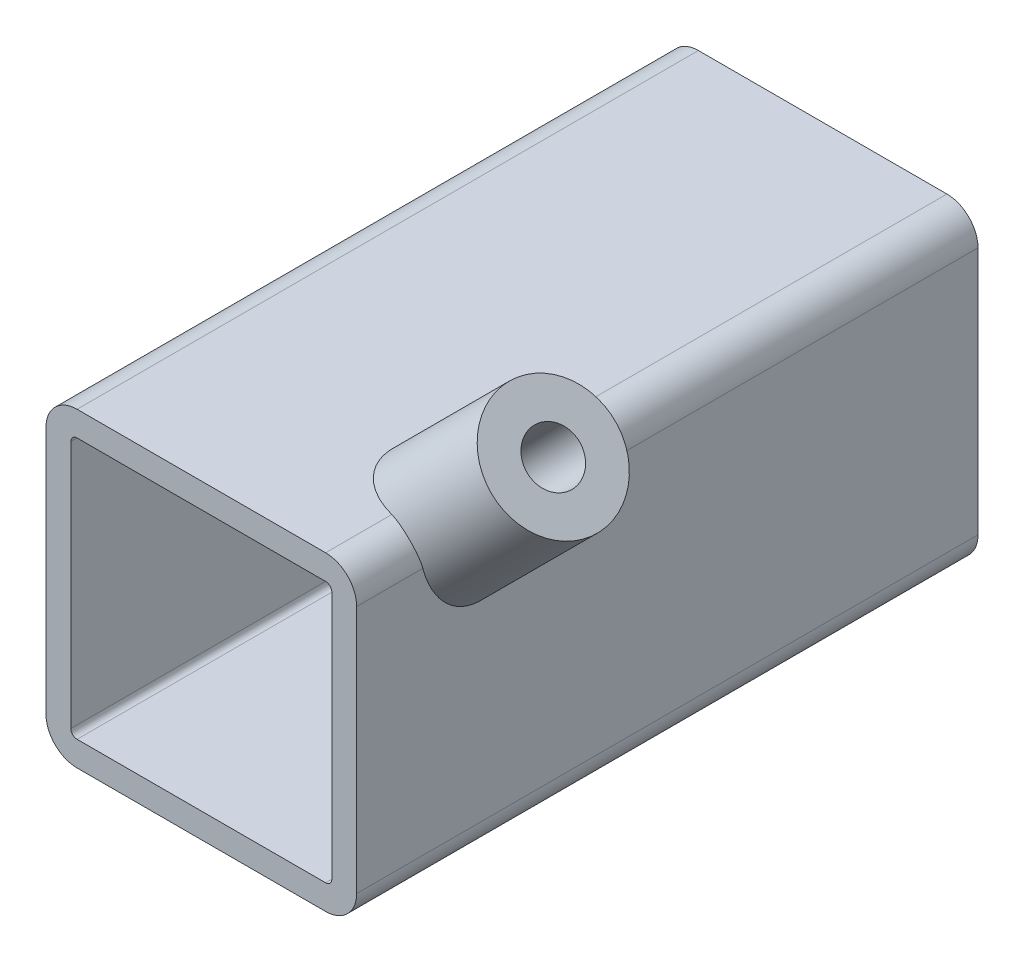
ISO-10303-21;
HEADER;
FILE_DESCRIPTION(('STEP AP214'),'2;1');
FILE_NAME('part.step','',(''),(''),'','','');
FILE_SCHEMA(('AUTOMOTIVE_DESIGN { 1 0 10303 214 1 1 1 1 }'));
ENDSEC;
DATA;
#1=APPLICATION_CONTEXT('core data for automotive mechanical design processes');
#2=APPLICATION_PROTOCOL_DEFINITION('international standard','automotive_design',2000,#1);
#3=PRODUCT_CONTEXT('',#1,'mechanical');
#4=PRODUCT('Part','Part','',(#3));
#5=PRODUCT_RELATED_PRODUCT_CATEGORY('part','',(#4));
#6=PRODUCT_DEFINITION_FORMATION('','',#4);
#7=PRODUCT_DEFINITION_CONTEXT('part definition',#1,'design');
#8=PRODUCT_DEFINITION('design','',#6,#7);
#9=PRODUCT_DEFINITION_SHAPE('','',#8);
#10=(LENGTH_UNIT() NAMED_UNIT(*) SI_UNIT(.MILLI.,.METRE.));
#11=(NAMED_UNIT(*) PLANE_ANGLE_UNIT() SI_UNIT($,.RADIAN.));
#12=(NAMED_UNIT(*) SI_UNIT($,.STERADIAN.) SOLID_ANGLE_UNIT());
#13=UNCERTAINTY_MEASURE_WITH_UNIT(LENGTH_MEASURE(1.E-05),#10,'distance_accuracy_value','');
#14=(GEOMETRIC_REPRESENTATION_CONTEXT(3) GLOBAL_UNCERTAINTY_ASSIGNED_CONTEXT((#13)) GLOBAL_UNIT_ASSIGNED_CONTEXT((#10,
#11,#12)) REPRESENTATION_CONTEXT('',''));
#15=CARTESIAN_POINT('',(0.,0.,0.));
#16=DIRECTION('',(0.,0.,1.));
#17=DIRECTION('',(1.,0.,0.));
#18=AXIS2_PLACEMENT_3D('',#15,#16,#17);
#19=CARTESIAN_POINT('',(45.,-5.,0.));
#20=DIRECTION('',(0.,0.,1.));
#21=DIRECTION('',(1.,0.,0.));
#22=AXIS2_PLACEMENT_3D('',#19,#20,#21);
#23=CYLINDRICAL_SURFACE('',#22,1.);
#24=DIRECTION('',(0.,0.,1.));
#25=VECTOR('',#24,1.);
#26=CARTESIAN_POINT('',(45.,-4.,0.));
#27=LINE('',#26,#25);
#28=CARTESIAN_POINT('',(45.,-4.,84.1907636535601));
#29=VERTEX_POINT('',#28);
#30=CARTESIAN_POINT('',(45.,-4.,100.));
#31=VERTEX_POINT('',#30);
#32=EDGE_CURVE('E50',#29,#31,#27,.T.);
#33=ORIENTED_EDGE('',*,*,#32,.F.);
#34=CARTESIAN_POINT('',(45.,-4.,84.1907636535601));
#35=CARTESIAN_POINT('',(45.0559582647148,-3.99995951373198,84.1974543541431));
#36=CARTESIAN_POINT('',(45.1119232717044,-4.0046950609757,84.2041038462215));
#37=CARTESIAN_POINT('',(45.2223794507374,-4.02344244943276,84.2166561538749));
#38=CARTESIAN_POINT('',(45.2768702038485,-4.03745689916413,84.2225587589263));
#39=CARTESIAN_POINT('',(45.3829114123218,-4.07450490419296,84.232953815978));
#40=CARTESIAN_POINT('',(45.4344588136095,-4.09754763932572,84.2374448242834));
#41=CARTESIAN_POINT('',(45.5330191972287,-4.15202775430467,84.244506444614));
#42=CARTESIAN_POINT('',(45.5800349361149,-4.18345998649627,84.247078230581));
#43=CARTESIAN_POINT('',(45.6673764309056,-4.25322116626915,84.24998609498));
#44=CARTESIAN_POINT('',(45.7078042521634,-4.29142076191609,84.2503602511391));
#45=CARTESIAN_POINT('',(45.7817667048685,-4.37397129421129,84.2489334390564));
#46=CARTESIAN_POINT('',(45.8153002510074,-4.41832319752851,84.2471321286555));
#47=CARTESIAN_POINT('',(45.8741924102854,-4.51134279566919,84.2415851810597));
#48=CARTESIAN_POINT('',(45.8996376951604,-4.55995707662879,84.2378613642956));
#49=CARTESIAN_POINT('',(45.9422124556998,-4.66056359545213,84.2288785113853));
#50=CARTESIAN_POINT('',(45.9593437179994,-4.71255510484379,84.2236198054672));
#51=CARTESIAN_POINT('',(45.9813894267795,-4.80394024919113,84.2137023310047));
#52=CARTESIAN_POINT('',(45.988366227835,-4.84287622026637,84.2092748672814));
#53=CARTESIAN_POINT('',(45.9976705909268,-4.92120482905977,84.2001569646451));
#54=CARTESIAN_POINT('',(46.0000056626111,-4.9605966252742,84.1954669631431));
#55=CARTESIAN_POINT('',(46.,-5.00000000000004,84.1907636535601));
#56=B_SPLINE_CURVE_WITH_KNOTS('',3,(#34,#35,#36,#37,#38,#39,#40,#41,#42,#43,#44,#45,#46,#47,#48,
#49,#50,#51,#52,#53,#54,#55),.UNSPECIFIED.,.F.,.F.,(4,2,2,2,2,2,2,2,2,2,4),(0.,
0.168877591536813,0.33780267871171,0.506899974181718,0.675893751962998,0.841950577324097,
1.00803352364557,1.17227157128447,1.33647430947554,1.45562186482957,1.57457649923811),.UNSPECIFIED.);
#57=CARTESIAN_POINT('',(46.,-5.00000000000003,84.1907636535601));
#58=VERTEX_POINT('',#57);
#59=EDGE_CURVE('E44',#29,#58,#56,.T.);
#60=ORIENTED_EDGE('',*,*,#59,.T.);
#61=DIRECTION('',(0.,0.,1.));
#62=VECTOR('',#61,1.);
#63=CARTESIAN_POINT('',(46.,-5.00000000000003,0.));
#64=LINE('',#63,#62);
#65=CARTESIAN_POINT('',(46.,-5.00000000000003,100.));
#66=VERTEX_POINT('',#65);
#67=EDGE_CURVE('E577',#58,#66,#64,.T.);
#68=ORIENTED_EDGE('',*,*,#67,.T.);
#69=CARTESIAN_POINT('',(45.,-5.,100.));
#70=DIRECTION('',(0.,0.,1.));
#71=DIRECTION('',(1.,0.,0.));
#72=AXIS2_PLACEMENT_3D('',#69,#70,#71);
#73=CIRCLE('',#72,1.);
#74=EDGE_CURVE('E534',#66,#31,#73,.T.);
#75=ORIENTED_EDGE('',*,*,#74,.T.);
#76=EDGE_LOOP('',(#33,#60,#68,#75));
#77=FACE_BOUND('',#76,.T.);
#78=ADVANCED_FACE('F29',(#77),#23,.F.);
#79=CARTESIAN_POINT('',(50.,-5.00000000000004,100.));
#80=DIRECTION('',(-1.,0.,0.));
#81=DIRECTION('',(0.,-1.,0.));
#82=AXIS2_PLACEMENT_3D('',#79,#80,#81);
#83=PLANE('',#82);
#84=CARTESIAN_POINT('',(50.,0.,80.));
#85=DIRECTION('',(-1.,0.,0.));
#86=DIRECTION('',(0.,-1.,0.));
#87=AXIS2_PLACEMENT_3D('',#84,#85,#86);
#88=ELLIPSE('',#87,14.1421356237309,10.);
#89=CARTESIAN_POINT('',(50.,-5.00000000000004,89.3541434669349));
#90=VERTEX_POINT('',#89);
#91=CARTESIAN_POINT('',(50.,-5.00000000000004,70.6458565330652));
#92=VERTEX_POINT('',#91);
#93=EDGE_CURVE('E278',#90,#92,#88,.F.);
#94=ORIENTED_EDGE('',*,*,#93,.F.);
#95=DIRECTION('',(0.,0.,-1.));
#96=VECTOR('',#95,1.);
#97=CARTESIAN_POINT('',(50.,-5.00000000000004,100.));
#98=LINE('',#97,#96);
#99=CARTESIAN_POINT('',(50.,-5.00000000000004,100.));
#100=VERTEX_POINT('',#99);
#101=EDGE_CURVE('E338',#100,#90,#98,.T.);
#102=ORIENTED_EDGE('',*,*,#101,.F.);
#103=DIRECTION('',(0.,1.,0.));
#104=VECTOR('',#103,1.);
#105=CARTESIAN_POINT('',(50.,-5.00000000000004,100.));
#106=LINE('',#105,#104);
#107=CARTESIAN_POINT('',(50.,-45.,100.));
#108=VERTEX_POINT('',#107);
#109=EDGE_CURVE('E305',#108,#100,#106,.T.);
#110=ORIENTED_EDGE('',*,*,#109,.F.);
#111=DIRECTION('',(0.,0.,-1.));
#112=VECTOR('',#111,1.);
#113=CARTESIAN_POINT('',(50.,-45.,100.));
#114=LINE('',#113,#112);
#115=CARTESIAN_POINT('',(50.,-45.,0.));
#116=VERTEX_POINT('',#115);
#117=EDGE_CURVE('E340',#108,#116,#114,.T.);
#118=ORIENTED_EDGE('',*,*,#117,.T.);
#119=DIRECTION('',(0.,1.,0.));
#120=VECTOR('',#119,1.);
#121=CARTESIAN_POINT('',(50.,-5.00000000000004,0.));
#122=LINE('',#121,#120);
#123=CARTESIAN_POINT('',(50.,-5.00000000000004,0.));
#124=VERTEX_POINT('',#123);
#125=EDGE_CURVE('E284',#116,#124,#122,.T.);
#126=ORIENTED_EDGE('',*,*,#125,.T.);
#127=EDGE_CURVE('E337',#92,#124,#98,.T.);
#128=ORIENTED_EDGE('',*,*,#127,.F.);
#129=EDGE_LOOP('',(#94,#102,#110,#118,#126,#128));
#130=FACE_BOUND('',#129,.T.);
#131=ADVANCED_FACE('F249',(#130),#83,.F.);
#132=CARTESIAN_POINT('',(45.,-5.,100.));
#133=DIRECTION('',(0.,0.,-1.));
#134=DIRECTION('',(-1.,0.,0.));
#135=AXIS2_PLACEMENT_3D('',#132,#133,#134);
#136=CYLINDRICAL_SURFACE('',#135,5.);
#137=CARTESIAN_POINT('',(40.,-5.,89.3541434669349));
#138=CARTESIAN_POINT('',(40.0000008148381,-4.72265838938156,89.2800167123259));
#139=CARTESIAN_POINT('',(40.0230750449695,-4.44531545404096,89.2049851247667));
#140=CARTESIAN_POINT('',(40.1154234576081,-3.89613450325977,89.060945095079));
#141=CARTESIAN_POINT('',(40.184782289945,-3.62430751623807,88.9919479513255));
#142=CARTESIAN_POINT('',(40.3233319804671,-3.225525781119,88.8992206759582));
#143=CARTESIAN_POINT('',(40.3754602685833,-3.09373839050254,88.8700404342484));
#144=CARTESIAN_POINT('',(40.4911309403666,-2.8343033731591,88.8163707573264));
#145=CARTESIAN_POINT('',(40.5546680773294,-2.70665387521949,88.7918791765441));
#146=CARTESIAN_POINT('',(40.6928077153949,-2.45668198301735,88.7485592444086));
#147=CARTESIAN_POINT('',(40.7673968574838,-2.33435338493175,88.729724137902));
#148=CARTESIAN_POINT('',(40.9272389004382,-2.09600346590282,88.6984738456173));
#149=CARTESIAN_POINT('',(41.0124904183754,-1.97998132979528,88.6860578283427));
#150=CARTESIAN_POINT('',(41.1848327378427,-1.7655481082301,88.6690079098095));
#151=CARTESIAN_POINT('',(41.2710636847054,-1.66649253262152,88.6637729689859));
#152=CARTESIAN_POINT('',(41.4511287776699,-1.47540879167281,88.6592775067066));
#153=CARTESIAN_POINT('',(41.5449624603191,-1.38338019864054,88.6600166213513));
#154=CARTESIAN_POINT('',(41.7394532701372,-1.20710376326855,88.6674405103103));
#155=CARTESIAN_POINT('',(41.840110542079,-1.12285608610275,88.6741254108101));
#156=CARTESIAN_POINT('',(42.0473877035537,-0.9627695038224,88.6931821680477));
#157=CARTESIAN_POINT('',(42.1540075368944,-0.886930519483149,88.7055539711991));
#158=CARTESIAN_POINT('',(42.3651026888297,-0.74886468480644,88.7345344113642));
#159=CARTESIAN_POINT('',(42.4692529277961,-0.6860691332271,88.7508084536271));
#160=CARTESIAN_POINT('',(42.681305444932,-0.568479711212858,88.7874196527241));
#161=CARTESIAN_POINT('',(42.7892089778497,-0.513688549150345,88.8077581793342));
#162=CARTESIAN_POINT('',(43.1175156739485,-0.361643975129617,88.8740190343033));
#163=CARTESIAN_POINT('',(43.3426487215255,-0.276632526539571,88.925206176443));
#164=CARTESIAN_POINT('',(43.8219139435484,-0.133747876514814,89.0416829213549));
#165=CARTESIAN_POINT('',(44.0767943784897,-0.0791387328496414,89.1078418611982));
#166=CARTESIAN_POINT('',(44.5909471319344,-0.0100042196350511,89.244165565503));
#167=CARTESIAN_POINT('',(44.8502221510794,0.00449553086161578,89.3143328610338));
#168=CARTESIAN_POINT('',(45.3970861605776,-0.007515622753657,89.4599150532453));
#169=CARTESIAN_POINT('',(45.68467738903,-0.0386744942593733,89.5350670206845));
#170=CARTESIAN_POINT('',(46.1104389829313,-0.122712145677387,89.6395642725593));
#171=CARTESIAN_POINT('',(46.2514992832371,-0.156970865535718,89.6730413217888));
#172=CARTESIAN_POINT('',(46.5308289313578,-0.237892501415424,89.7363544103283));
#173=CARTESIAN_POINT('',(46.6690996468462,-0.284549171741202,89.7661922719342));
#174=CARTESIAN_POINT('',(46.9387964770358,-0.388977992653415,89.8207663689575));
#175=CARTESIAN_POINT('',(47.0703062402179,-0.446483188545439,89.8456003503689));
#176=CARTESIAN_POINT('',(47.3285138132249,-0.572961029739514,89.8902515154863));
#177=CARTESIAN_POINT('',(47.4552139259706,-0.641928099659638,89.9100711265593));
#178=CARTESIAN_POINT('',(47.7026611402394,-0.790906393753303,89.9441065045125));
#179=CARTESIAN_POINT('',(47.8234111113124,-0.87091222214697,89.9583249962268));
#180=CARTESIAN_POINT('',(48.0578626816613,-1.04140463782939,89.9807291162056));
#181=CARTESIAN_POINT('',(48.1715650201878,-1.13189012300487,89.9889153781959));
#182=CARTESIAN_POINT('',(48.3797733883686,-1.31296742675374,89.9984906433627));
#183=CARTESIAN_POINT('',(48.4750598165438,-1.40263259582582,90.0004806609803));
#184=CARTESIAN_POINT('',(48.6583273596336,-1.58917310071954,89.9993234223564));
#185=CARTESIAN_POINT('',(48.7463060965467,-1.68605076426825,89.996174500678));
#186=CARTESIAN_POINT('',(48.914224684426,-1.88617604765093,89.9848203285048));
#187=CARTESIAN_POINT('',(48.9941684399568,-1.98942053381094,89.9766175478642));
#188=CARTESIAN_POINT('',(49.1455561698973,-2.20154484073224,89.955365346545));
#189=CARTESIAN_POINT('',(49.2169969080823,-2.3104267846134,89.9423140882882));
#190=CARTESIAN_POINT('',(49.3487716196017,-2.52937678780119,89.9121830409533));
#191=CARTESIAN_POINT('',(49.4093887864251,-2.6392942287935,89.8952462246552));
#192=CARTESIAN_POINT('',(49.5219771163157,-2.86285037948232,89.8575255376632));
#193=CARTESIAN_POINT('',(49.57394527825,-2.97649036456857,89.8367403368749));
#194=CARTESIAN_POINT('',(49.7165361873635,-3.32184055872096,89.7692828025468));
#195=CARTESIAN_POINT('',(49.7939446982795,-3.55814713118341,89.7174846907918));
#196=CARTESIAN_POINT('',(49.9169476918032,-4.05461639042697,89.6004421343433));
#197=CARTESIAN_POINT('',(49.959846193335,-4.31527073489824,89.5344975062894));
#198=CARTESIAN_POINT('',(50.0043173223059,-4.83888911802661,89.3976996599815));
#199=CARTESIAN_POINT('',(50.005860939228,-5.10185464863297,89.3268430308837));
#200=CARTESIAN_POINT('',(49.9658816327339,-5.64975877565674,89.1800506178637));
#201=CARTESIAN_POINT('',(49.920344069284,-5.93446889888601,89.1042545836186));
#202=CARTESIAN_POINT('',(49.8153130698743,-6.3541157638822,88.9986584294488));
#203=CARTESIAN_POINT('',(49.774147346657,-6.49284011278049,88.96479204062));
#204=CARTESIAN_POINT('',(49.6796217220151,-6.76695289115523,88.9008920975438));
#205=CARTESIAN_POINT('',(49.6262682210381,-6.90234303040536,88.8708565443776));
#206=CARTESIAN_POINT('',(49.508600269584,-7.16634036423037,88.8162322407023));
#207=CARTESIAN_POINT('',(49.44450432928,-7.29502635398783,88.7915538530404));
#208=CARTESIAN_POINT('',(49.3050140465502,-7.54707321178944,88.7479433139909));
#209=CARTESIAN_POINT('',(49.2296257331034,-7.67043687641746,88.7290081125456));
#210=CARTESIAN_POINT('',(49.0680728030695,-7.91062028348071,88.6976975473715));
#211=CARTESIAN_POINT('',(48.9819182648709,-8.02744599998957,88.6853161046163));
#212=CARTESIAN_POINT('',(48.7994774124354,-8.25346805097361,88.6676583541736));
#213=CARTESIAN_POINT('',(48.7031925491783,-8.36266547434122,88.6623810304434));
#214=CARTESIAN_POINT('',(48.5141854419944,-8.55902445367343,88.6593793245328));
#215=CARTESIAN_POINT('',(48.4225533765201,-8.64722612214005,88.6607839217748));
#216=CARTESIAN_POINT('',(48.2329479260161,-8.81630537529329,88.6691455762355));
#217=CARTESIAN_POINT('',(48.1349725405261,-8.89718063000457,88.6761043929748));
#218=CARTESIAN_POINT('',(47.9335068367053,-9.05099891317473,88.6953272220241));
#219=CARTESIAN_POINT('',(47.8300176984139,-9.12394362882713,88.7075901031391));
#220=CARTESIAN_POINT('',(47.618292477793,-9.26151498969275,88.7369913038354));
#221=CARTESIAN_POINT('',(47.5100545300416,-9.32613832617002,88.7541315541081));
#222=CARTESIAN_POINT('',(47.184634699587,-9.50415569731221,88.8111451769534));
#223=CARTESIAN_POINT('',(46.961765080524,-9.60546426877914,88.8571332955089));
#224=CARTESIAN_POINT('',(46.5062037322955,-9.77393829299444,88.9606253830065));
#225=CARTESIAN_POINT('',(46.2735085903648,-9.84109177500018,89.0181333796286));
#226=CARTESIAN_POINT('',(45.7747538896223,-9.94693240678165,89.14643225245));
#227=CARTESIAN_POINT('',(45.5079842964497,-9.98135253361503,89.2179899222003));
#228=CARTESIAN_POINT('',(44.9722544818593,-10.0071093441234,89.3616535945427));
#229=CARTESIAN_POINT('',(44.7032929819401,-9.99841877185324,89.4337599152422));
#230=CARTESIAN_POINT('',(44.2915496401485,-9.95169753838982,89.5400128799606));
#231=CARTESIAN_POINT('',(44.1474678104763,-9.92894988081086,89.5764029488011));
#232=CARTESIAN_POINT('',(43.8612083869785,-9.87077611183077,89.6463551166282));
#233=CARTESIAN_POINT('',(43.7190300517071,-9.83535509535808,89.6799183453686));
#234=CARTESIAN_POINT('',(43.4375561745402,-9.75187589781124,89.7432756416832));
#235=CARTESIAN_POINT('',(43.2982608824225,-9.70381662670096,89.7730693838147));
#236=CARTESIAN_POINT('',(43.023739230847,-9.59523261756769,89.8279995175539));
#237=CARTESIAN_POINT('',(42.8885106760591,-9.53471474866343,89.8531384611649));
#238=CARTESIAN_POINT('',(42.630818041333,-9.40528839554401,89.8967285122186));
#239=CARTESIAN_POINT('',(42.5080657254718,-9.33705469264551,89.9154791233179));
#240=CARTESIAN_POINT('',(42.2682936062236,-9.19017100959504,89.9476314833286));
#241=CARTESIAN_POINT('',(42.1512710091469,-9.1115261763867,89.961035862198));
#242=CARTESIAN_POINT('',(41.9240087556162,-8.94438408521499,89.9821086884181));
#243=CARTESIAN_POINT('',(41.8137662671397,-8.85589098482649,89.9897795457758));
#244=CARTESIAN_POINT('',(41.601038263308,-8.66974524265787,89.9991620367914));
#245=CARTESIAN_POINT('',(41.498552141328,-8.5720933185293,90.0008741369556));
#246=CARTESIAN_POINT('',(41.3115267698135,-8.37810174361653,89.9984118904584));
#247=CARTESIAN_POINT('',(41.2262064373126,-8.28250609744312,89.994777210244));
#248=CARTESIAN_POINT('',(41.0632623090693,-8.08520210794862,89.9826704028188));
#249=CARTESIAN_POINT('',(40.9856410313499,-7.98349178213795,89.9741966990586));
#250=CARTESIAN_POINT('',(40.8386310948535,-7.7747608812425,89.9526170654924));
#251=CARTESIAN_POINT('',(40.7692418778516,-7.66774066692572,89.9395114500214));
#252=CARTESIAN_POINT('',(40.6390599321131,-7.44916486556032,89.9089874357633));
#253=CARTESIAN_POINT('',(40.5782703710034,-7.33760762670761,89.891567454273));
#254=CARTESIAN_POINT('',(40.4093571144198,-6.99748285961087,89.8334433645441));
#255=CARTESIAN_POINT('',(40.3144915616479,-6.76318051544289,89.7868444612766));
#256=CARTESIAN_POINT('',(40.1616411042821,-6.28574567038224,89.6820427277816));
#257=CARTESIAN_POINT('',(40.1036206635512,-6.04262191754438,89.62385114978));
#258=CARTESIAN_POINT('',(40.0426595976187,-5.66537431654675,89.5290317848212));
#259=CARTESIAN_POINT('',(40.0266584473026,-5.53261985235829,89.4948159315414));
#260=CARTESIAN_POINT('',(40.0053284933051,-5.26657702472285,89.425184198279));
#261=CARTESIAN_POINT('',(39.9999996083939,-5.13328866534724,89.3897683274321));
#262=CARTESIAN_POINT('',(40.,-5.,89.3541434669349));
#263=B_SPLINE_CURVE_WITH_KNOTS('',3,(#137,#138,#139,#140,#141,#142,#143,#144,#145,#146,#147,
#148,#149,#150,#151,#152,#153,#154,#155,#156,#157,#158,#159,#160,#161,#162,#163,#164,#165,#166,
#167,#168,#169,#170,#171,#172,#173,#174,#175,#176,#177,#178,#179,#180,#181,#182,#183,#184,#185,
#186,#187,#188,#189,#190,#191,#192,#193,#194,#195,#196,#197,#198,#199,#200,#201,#202,#203,#204,
#205,#206,#207,#208,#209,#210,#211,#212,#213,#214,#215,#216,#217,#218,#219,#220,#221,#222,#223,
#224,#225,#226,#227,#228,#229,#230,#231,#232,#233,#234,#235,#236,#237,#238,#239,#240,#241,#242,
#243,#244,#245,#246,#247,#248,#249,#250,#251,#252,#253,#254,#255,#256,#257,#258,#259,#260,#261,
#262),.UNSPECIFIED.,.T.,.F.,(4,2,2,2,2,2,2,2,2,2,2,2,2,2,2,2,2,2,2,2,2,2,2,2,2,2,2,2,2,2,2,2,2,
2,2,2,2,2,2,2,2,2,2,2,2,2,2,2,2,2,2,2,2,2,2,2,2,2,2,2,2,2,4),(0.,0.860790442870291,
1.72315951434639,2.15675818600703,2.59015796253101,3.02303808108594,3.45586211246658,
3.84963683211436,4.24338756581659,4.6371466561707,5.03090203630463,5.39859766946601,
5.76641742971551,6.50157996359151,7.30519709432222,8.10932740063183,9.00120866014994,
9.44764890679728,9.89386467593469,10.330269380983,10.7664624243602,11.202443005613,
11.6383777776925,12.0304525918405,12.4226544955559,12.8146648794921,13.2068239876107,
13.5863779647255,13.9660633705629,14.7248557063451,15.5383532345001,16.352421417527,
17.2421247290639,17.6874942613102,18.1326304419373,18.5696186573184,19.0063743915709,
19.4427242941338,19.8790117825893,20.2601073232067,20.6413236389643,21.0224586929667,
21.4037448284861,22.147741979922,22.8919997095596,23.7236251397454,24.555776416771,
25.0063055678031,25.4566538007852,25.9070408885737,26.3571803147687,26.7816649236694,
27.2059404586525,27.6300375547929,28.0541014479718,28.4381914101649,28.8224065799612,
29.2065956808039,29.5909259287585,30.358562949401,31.1254584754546,31.5391521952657,
31.95284276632),.UNSPECIFIED.);
#264=CARTESIAN_POINT('',(45.,0.,89.3541434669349));
#265=VERTEX_POINT('',#264);
#266=EDGE_CURVE('E199',#265,#90,#263,.T.);
#267=ORIENTED_EDGE('',*,*,#266,.F.);
#268=DIRECTION('',(0.,0.,-1.));
#269=VECTOR('',#268,1.);
#270=CARTESIAN_POINT('',(45.,0.,100.));
#271=LINE('',#270,#269);
#272=CARTESIAN_POINT('',(45.,0.,100.));
#273=VERTEX_POINT('',#272);
#274=EDGE_CURVE('E335',#273,#265,#271,.T.);
#275=ORIENTED_EDGE('',*,*,#274,.F.);
#276=CARTESIAN_POINT('',(45.,-5.,100.));
#277=DIRECTION('',(0.,0.,1.));
#278=DIRECTION('',(1.,0.,0.));
#279=AXIS2_PLACEMENT_3D('',#276,#277,#278);
#280=CIRCLE('',#279,5.);
#281=EDGE_CURVE('E307',#100,#273,#280,.T.);
#282=ORIENTED_EDGE('',*,*,#281,.F.);
#283=ORIENTED_EDGE('',*,*,#101,.T.);
#284=EDGE_LOOP('',(#267,#275,#282,#283));
#285=FACE_BOUND('',#284,.T.);
#286=ADVANCED_FACE('F203',(#285),#136,.T.);
#287=CARTESIAN_POINT('',(40.,-5.,70.6458565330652));
#288=CARTESIAN_POINT('',(40.0000019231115,-5.27425698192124,70.5725616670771));
#289=CARTESIAN_POINT('',(40.0225673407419,-5.54895561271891,70.5000282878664));
#290=CARTESIAN_POINT('',(40.1132394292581,-6.09350953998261,70.3635772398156));
#291=CARTESIAN_POINT('',(40.1814101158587,-6.36335748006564,70.2996718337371));
#292=CARTESIAN_POINT('',(40.3176179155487,-6.75924685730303,70.2150946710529));
#293=CARTESIAN_POINT('',(40.3688448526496,-6.89003568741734,70.1887323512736));
#294=CARTESIAN_POINT('',(40.4824794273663,-7.14750472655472,70.1405241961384));
#295=CARTESIAN_POINT('',(40.5448822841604,-7.27418666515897,70.1186764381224));
#296=CARTESIAN_POINT('',(40.6805219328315,-7.52231923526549,70.0801266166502));
#297=CARTESIAN_POINT('',(40.7537515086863,-7.64377328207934,70.0634211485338));
#298=CARTESIAN_POINT('',(40.9106065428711,-7.88045275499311,70.0356248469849));
#299=CARTESIAN_POINT('',(40.9942310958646,-7.99567872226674,70.0245335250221));
#300=CARTESIAN_POINT('',(41.1647506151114,-8.21065193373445,70.0088942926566));
#301=CARTESIAN_POINT('',(41.2509581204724,-8.31091481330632,70.0039268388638));
#302=CARTESIAN_POINT('',(41.4311481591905,-8.50439380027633,69.9992308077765));
#303=CARTESIAN_POINT('',(41.5251333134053,-8.59760751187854,69.9995040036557));
#304=CARTESIAN_POINT('',(41.7200634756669,-8.77617263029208,70.0052857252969));
#305=CARTESIAN_POINT('',(41.8210052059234,-8.86152769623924,70.0107918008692));
#306=CARTESIAN_POINT('',(42.0291088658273,-9.02383235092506,70.0268920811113));
#307=CARTESIAN_POINT('',(42.1362731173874,-9.10077877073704,70.0374881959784));
#308=CARTESIAN_POINT('',(42.350941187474,-9.24243583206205,70.0629044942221));
#309=CARTESIAN_POINT('',(42.458208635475,-9.30754341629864,70.0775110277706));
#310=CARTESIAN_POINT('',(42.676855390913,-9.42929800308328,70.1107708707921));
#311=CARTESIAN_POINT('',(42.7882361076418,-9.4859420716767,70.1294255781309));
#312=CARTESIAN_POINT('',(43.1273737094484,-9.64275665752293,70.1908548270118));
#313=CARTESIAN_POINT('',(43.3602997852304,-9.72992352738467,70.2391160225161));
#314=CARTESIAN_POINT('',(43.8484806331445,-9.87264555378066,70.3494708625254));
#315=CARTESIAN_POINT('',(44.1042313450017,-9.9259522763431,70.4122279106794));
#316=CARTESIAN_POINT('',(44.619380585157,-9.99225489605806,70.5441515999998));
#317=CARTESIAN_POINT('',(44.8787812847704,-10.005225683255,70.6133222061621));
#318=CARTESIAN_POINT('',(45.4216669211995,-9.99029233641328,70.7588253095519));
#319=CARTESIAN_POINT('',(45.7050316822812,-9.95827556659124,70.8351979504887));
#320=CARTESIAN_POINT('',(46.2644970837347,-9.8458539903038,70.9799048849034));
#321=CARTESIAN_POINT('',(46.540596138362,-9.76543871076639,71.0482374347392));
#322=CARTESIAN_POINT('',(46.9438740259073,-9.60893784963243,71.1380239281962));
#323=CARTESIAN_POINT('',(47.0767361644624,-9.55064257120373,71.1658757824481));
#324=CARTESIAN_POINT('',(47.3376666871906,-9.42226373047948,71.2162362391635));
#325=CARTESIAN_POINT('',(47.4657375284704,-9.35218631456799,71.2387476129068));
#326=CARTESIAN_POINT('',(47.715810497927,-9.2006822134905,71.2774627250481));
#327=CARTESIAN_POINT('',(47.837818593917,-9.11926700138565,71.2936727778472));
#328=CARTESIAN_POINT('',(48.0746628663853,-8.94562995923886,71.3190776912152));
#329=CARTESIAN_POINT('',(48.1895001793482,-8.85340984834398,71.3282736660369));
#330=CARTESIAN_POINT('',(48.3971725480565,-8.67095509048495,71.3385410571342));
#331=CARTESIAN_POINT('',(48.49097731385,-8.58186875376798,71.3404719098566));
#332=CARTESIAN_POINT('',(48.6714011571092,-8.39669375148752,71.3385323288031));
#333=CARTESIAN_POINT('',(48.7580179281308,-8.30060285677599,71.3346600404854));
#334=CARTESIAN_POINT('',(48.923342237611,-8.10226415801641,71.3212553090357));
#335=CARTESIAN_POINT('',(49.0020523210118,-8.00001835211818,71.3117246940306));
#336=CARTESIAN_POINT('',(49.1510900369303,-7.7901690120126,71.2873621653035));
#337=CARTESIAN_POINT('',(49.221414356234,-7.68256338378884,71.272528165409));
#338=CARTESIAN_POINT('',(49.4128994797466,-7.36341910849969,71.2224479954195));
#339=CARTESIAN_POINT('',(49.5225703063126,-7.14583355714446,71.1808697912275));
#340=CARTESIAN_POINT('',(49.7084669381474,-6.69967700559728,71.0849274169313));
#341=CARTESIAN_POINT('',(49.7846819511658,-6.47110248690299,71.0305591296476));
#342=CARTESIAN_POINT('',(49.9096833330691,-5.98245286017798,70.9080395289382));
#343=CARTESIAN_POINT('',(49.9546712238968,-5.72162057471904,70.839036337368));
#344=CARTESIAN_POINT('',(50.003089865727,-5.19652651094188,70.6986422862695));
#345=CARTESIAN_POINT('',(50.0064934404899,-4.93226260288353,70.6272498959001));
#346=CARTESIAN_POINT('',(49.979445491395,-4.52446918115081,70.5199814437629));
#347=CARTESIAN_POINT('',(49.963567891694,-4.38023069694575,70.4826065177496));
#348=CARTESIAN_POINT('',(49.9192155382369,-4.0931417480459,70.4101349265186));
#349=CARTESIAN_POINT('',(49.8907455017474,-3.95029078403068,70.3750374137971));
#350=CARTESIAN_POINT('',(49.8212109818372,-3.66687450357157,70.3080791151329));
#351=CARTESIAN_POINT('',(49.7801435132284,-3.52630973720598,70.276219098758));
#352=CARTESIAN_POINT('',(49.685523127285,-3.24860808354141,70.2166654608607));
#353=CARTESIAN_POINT('',(49.6319768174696,-3.11146942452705,70.1889696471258));
#354=CARTESIAN_POINT('',(49.5149844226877,-2.84710323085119,70.1395587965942));
#355=CARTESIAN_POINT('',(49.4520210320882,-2.71969875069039,70.1176485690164));
#356=CARTESIAN_POINT('',(49.315115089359,-2.47017399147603,70.0790426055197));
#357=CARTESIAN_POINT('',(49.2411779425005,-2.3480511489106,70.0623443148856));
#358=CARTESIAN_POINT('',(49.0828181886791,-2.11019024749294,70.0346514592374));
#359=CARTESIAN_POINT('',(48.9984001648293,-1.994449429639,70.0236544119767));
#360=CARTESIAN_POINT('',(48.8197125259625,-1.77039909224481,70.0076922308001));
#361=CARTESIAN_POINT('',(48.7254438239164,-1.6620888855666,70.0027265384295));
#362=CARTESIAN_POINT('',(48.5376599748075,-1.46422772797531,69.9991641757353));
#363=CARTESIAN_POINT('',(48.4449920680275,-1.37388084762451,69.9999862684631));
#364=CARTESIAN_POINT('',(48.2529977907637,-1.20069446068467,70.0066293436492));
#365=CARTESIAN_POINT('',(48.1536692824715,-1.11785738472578,70.0124519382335));
#366=CARTESIAN_POINT('',(47.9491980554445,-0.960336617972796,70.0289476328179));
#367=CARTESIAN_POINT('',(47.8440578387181,-0.885649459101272,70.039618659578));
#368=CARTESIAN_POINT('',(47.6286901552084,-0.744820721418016,70.0655496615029));
#369=CARTESIAN_POINT('',(47.5184607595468,-0.678682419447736,70.0808113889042));
#370=CARTESIAN_POINT('',(47.295676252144,-0.55638234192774,70.1152596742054));
#371=CARTESIAN_POINT('',(47.18319294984,-0.500069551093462,70.1343747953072));
#372=CARTESIAN_POINT('',(46.9548635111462,-0.396277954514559,70.1762517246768));
#373=CARTESIAN_POINT('',(46.8390162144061,-0.348802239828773,70.1990148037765));
#374=CARTESIAN_POINT('',(46.487559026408,-0.219900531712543,70.2720468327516));
#375=CARTESIAN_POINT('',(46.2478744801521,-0.151913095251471,70.3270842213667));
#376=CARTESIAN_POINT('',(45.7434428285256,-0.0483382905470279,70.4501552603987));
#377=CARTESIAN_POINT('',(45.4782426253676,-0.0158351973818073,70.5188817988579));
#378=CARTESIAN_POINT('',(44.9468090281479,0.00679767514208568,70.6596763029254));
#379=CARTESIAN_POINT('',(44.6805750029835,-0.00310470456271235,70.7317467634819));
#380=CARTESIAN_POINT('',(44.1291944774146,-0.06795539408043,70.8785207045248));
#381=CARTESIAN_POINT('',(43.8443841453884,-0.126694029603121,70.9529199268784));
#382=CARTESIAN_POINT('',(43.4261491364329,-0.251921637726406,71.054467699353));
#383=CARTESIAN_POINT('',(43.2881729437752,-0.299881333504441,71.0866542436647));
#384=CARTESIAN_POINT('',(43.0161440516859,-0.408082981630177,71.1465345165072));
#385=CARTESIAN_POINT('',(42.8820891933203,-0.468318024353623,71.1742307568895));
#386=CARTESIAN_POINT('',(42.6241638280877,-0.598246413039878,71.2230595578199));
#387=CARTESIAN_POINT('',(42.5001001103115,-0.667475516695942,71.2444071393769));
#388=CARTESIAN_POINT('',(42.2577399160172,-0.816671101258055,71.2810818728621));
#389=CARTESIAN_POINT('',(42.1394403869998,-0.896631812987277,71.2964122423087));
#390=CARTESIAN_POINT('',(41.9097869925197,-1.06668322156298,71.3203914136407));
#391=CARTESIAN_POINT('',(41.7984273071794,-1.15676524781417,71.3290458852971));
#392=CARTESIAN_POINT('',(41.5836812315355,-1.34633455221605,71.3392972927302));
#393=CARTESIAN_POINT('',(41.4802938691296,-1.44582068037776,71.3408950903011));
#394=CARTESIAN_POINT('',(41.2949429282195,-1.6401994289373,71.337211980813));
#395=CARTESIAN_POINT('',(41.211919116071,-1.73410126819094,71.3327692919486));
#396=CARTESIAN_POINT('',(41.0533062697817,-1.92766067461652,71.3185951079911));
#397=CARTESIAN_POINT('',(40.9777196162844,-2.0273200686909,71.3088619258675));
#398=CARTESIAN_POINT('',(40.8344677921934,-2.2316238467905,71.2844350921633));
#399=CARTESIAN_POINT('',(40.7668039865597,-2.33626908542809,71.2697405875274));
#400=CARTESIAN_POINT('',(40.6397366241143,-2.54978373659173,71.2358745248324));
#401=CARTESIAN_POINT('',(40.5803362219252,-2.6586547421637,71.216701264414));
#402=CARTESIAN_POINT('',(40.4148853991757,-2.99057927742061,71.1533027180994));
#403=CARTESIAN_POINT('',(40.3215548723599,-3.21898808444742,71.1031930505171));
#404=CARTESIAN_POINT('',(40.1699842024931,-3.68437329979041,70.9927366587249));
#405=CARTESIAN_POINT('',(40.11171192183,-3.92134164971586,70.9323993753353));
#406=CARTESIAN_POINT('',(40.0473279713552,-4.29937189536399,70.8333175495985));
#407=CARTESIAN_POINT('',(40.0295896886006,-4.43896457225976,70.7961330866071));
#408=CARTESIAN_POINT('',(40.005924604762,-4.71899944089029,70.7211846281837));
#409=CARTESIAN_POINT('',(39.9999990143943,-4.85944171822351,70.6834205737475));
#410=CARTESIAN_POINT('',(40.,-5.,70.6458565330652));
#411=B_SPLINE_CURVE_WITH_KNOTS('',3,(#287,#288,#289,#290,#291,#292,#293,#294,#295,#296,#297,
#298,#299,#300,#301,#302,#303,#304,#305,#306,#307,#308,#309,#310,#311,#312,#313,#314,#315,#316,
#317,#318,#319,#320,#321,#322,#323,#324,#325,#326,#327,#328,#329,#330,#331,#332,#333,#334,#335,
#336,#337,#338,#339,#340,#341,#342,#343,#344,#345,#346,#347,#348,#349,#350,#351,#352,#353,#354,
#355,#356,#357,#358,#359,#360,#361,#362,#363,#364,#365,#366,#367,#368,#369,#370,#371,#372,#373,
#374,#375,#376,#377,#378,#379,#380,#381,#382,#383,#384,#385,#386,#387,#388,#389,#390,#391,#392,
#393,#394,#395,#396,#397,#398,#399,#400,#401,#402,#403,#404,#405,#406,#407,#408,#409,#410),
.UNSPECIFIED.,.T.,.F.,(4,2,2,2,2,2,2,2,2,2,2,2,2,2,2,2,2,2,2,2,2,2,2,2,2,2,2,2,2,2,2,2,2,2,2,2,
2,2,2,2,2,2,2,2,2,2,2,2,2,2,2,2,2,2,2,2,2,2,2,2,2,4),(0.,0.851183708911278,1.7035647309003,
2.13183636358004,2.55992522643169,2.98773004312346,3.41549762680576,3.81195300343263,
4.20854252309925,4.60494643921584,5.00149923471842,5.38004571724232,5.7587231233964,
6.51545845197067,7.31827887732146,8.12159897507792,9.00331731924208,9.88522652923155,
10.3279079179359,10.7703590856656,11.2123657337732,11.6543021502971,12.0419375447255,
12.4296968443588,12.8173309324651,13.2051176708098,13.9433416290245,14.6818035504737,
15.4991293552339,16.3169892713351,16.7660590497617,17.214960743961,17.663968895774,
18.1127398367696,18.5435273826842,18.974103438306,19.4044918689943,19.8348404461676,
20.2226346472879,20.6105539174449,20.9983074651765,21.386209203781,21.7674900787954,
22.1489040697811,22.9111882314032,23.7354596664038,24.5603563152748,25.4559964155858,
25.9042281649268,26.3522083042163,26.7825986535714,27.2127585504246,27.6425527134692,
28.0722943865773,28.4480964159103,28.8240183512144,29.2000049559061,29.5761347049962,
30.3282351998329,31.0796451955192,31.5158370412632,31.9520735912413),.UNSPECIFIED.);
#412=CARTESIAN_POINT('',(45.,0.,70.6458565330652));
#413=VERTEX_POINT('',#412);
#414=EDGE_CURVE('E192',#92,#413,#411,.T.);
#415=ORIENTED_EDGE('',*,*,#414,.F.);
#416=ORIENTED_EDGE('',*,*,#127,.T.);
#417=CARTESIAN_POINT('',(45.,-5.,0.));
#418=DIRECTION('',(0.,0.,1.));
#419=DIRECTION('',(1.,0.,0.));
#420=AXIS2_PLACEMENT_3D('',#417,#418,#419);
#421=CIRCLE('',#420,5.);
#422=CARTESIAN_POINT('',(45.,0.,0.));
#423=VERTEX_POINT('',#422);
#424=EDGE_CURVE('E289',#124,#423,#421,.T.);
#425=ORIENTED_EDGE('',*,*,#424,.T.);
#426=EDGE_CURVE('E334',#413,#423,#271,.T.);
#427=ORIENTED_EDGE('',*,*,#426,.F.);
#428=EDGE_LOOP('',(#415,#416,#425,#427));
#429=FACE_BOUND('',#428,.T.);
#430=ADVANCED_FACE('F240',(#429),#136,.T.);
#431=CARTESIAN_POINT('',(5.00000000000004,0.,100.));
#432=DIRECTION('',(0.,-1.,0.));
#433=DIRECTION('',(0.,0.,-1.));
#434=AXIS2_PLACEMENT_3D('',#431,#432,#433);
#435=PLANE('',#434);
#436=CARTESIAN_POINT('',(50.,0.,80.));
#437=DIRECTION('',(0.,-1.,0.));
#438=DIRECTION('',(-1.,0.,0.));
#439=AXIS2_PLACEMENT_3D('',#436,#437,#438);
#440=ELLIPSE('',#439,14.142135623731,10.);
#441=EDGE_CURVE('E37',#413,#265,#440,.F.);
#442=ORIENTED_EDGE('',*,*,#441,.F.);
#443=ORIENTED_EDGE('',*,*,#426,.T.);
#444=DIRECTION('',(-1.,0.,0.));
#445=VECTOR('',#444,1.);
#446=CARTESIAN_POINT('',(5.00000000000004,0.,0.));
#447=LINE('',#446,#445);
#448=CARTESIAN_POINT('',(5.00000000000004,0.,0.));
#449=VERTEX_POINT('',#448);
#450=EDGE_CURVE('E292',#423,#449,#447,.T.);
#451=ORIENTED_EDGE('',*,*,#450,.T.);
#452=DIRECTION('',(0.,0.,-1.));
#453=VECTOR('',#452,1.);
#454=CARTESIAN_POINT('',(5.00000000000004,0.,100.));
#455=LINE('',#454,#453);
#456=CARTESIAN_POINT('',(5.00000000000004,0.,100.));
#457=VERTEX_POINT('',#456);
#458=EDGE_CURVE('E331',#457,#449,#455,.T.);
#459=ORIENTED_EDGE('',*,*,#458,.F.);
#460=DIRECTION('',(-1.,0.,0.));
#461=VECTOR('',#460,1.);
#462=CARTESIAN_POINT('',(5.00000000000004,0.,100.));
#463=LINE('',#462,#461);
#464=EDGE_CURVE('E309',#273,#457,#463,.T.);
#465=ORIENTED_EDGE('',*,*,#464,.F.);
#466=ORIENTED_EDGE('',*,*,#274,.T.);
#467=EDGE_LOOP('',(#442,#443,#451,#459,#465,#466));
#468=FACE_BOUND('',#467,.T.);
#469=ADVANCED_FACE('F238',(#468),#435,.F.);
#470=CARTESIAN_POINT('',(45.,-45.,100.));
#471=DIRECTION('',(0.,0.,-1.));
#472=DIRECTION('',(-1.,0.,0.));
#473=AXIS2_PLACEMENT_3D('',#470,#471,#472);
#474=CYLINDRICAL_SURFACE('',#473,5.);
#475=CARTESIAN_POINT('',(45.,-45.,0.));
#476=DIRECTION('',(0.,0.,1.));
#477=DIRECTION('',(-1.,0.,0.));
#478=AXIS2_PLACEMENT_3D('',#475,#476,#477);
#479=CIRCLE('',#478,5.);
#480=CARTESIAN_POINT('',(45.,-50.,0.));
#481=VERTEX_POINT('',#480);
#482=EDGE_CURVE('E282',#481,#116,#479,.T.);
#483=ORIENTED_EDGE('',*,*,#482,.T.);
#484=ORIENTED_EDGE('',*,*,#117,.F.);
#485=CARTESIAN_POINT('',(45.,-45.,100.));
#486=DIRECTION('',(0.,0.,1.));
#487=DIRECTION('',(-1.,0.,0.));
#488=AXIS2_PLACEMENT_3D('',#485,#486,#487);
#489=CIRCLE('',#488,5.);
#490=CARTESIAN_POINT('',(45.,-50.,100.));
#491=VERTEX_POINT('',#490);
#492=EDGE_CURVE('E302',#491,#108,#489,.T.);
#493=ORIENTED_EDGE('',*,*,#492,.F.);
#494=DIRECTION('',(0.,0.,-1.));
#495=VECTOR('',#494,1.);
#496=CARTESIAN_POINT('',(45.,-50.,100.));
#497=LINE('',#496,#495);
#498=EDGE_CURVE('E319',#491,#481,#497,.T.);
#499=ORIENTED_EDGE('',*,*,#498,.T.);
#500=EDGE_LOOP('',(#483,#484,#493,#499));
#501=FACE_BOUND('',#500,.T.);
#502=ADVANCED_FACE('F31',(#501),#474,.T.);
#503=CARTESIAN_POINT('',(5.,-5.,100.));
#504=DIRECTION('',(0.,0.,-1.));
#505=DIRECTION('',(-1.,0.,0.));
#506=AXIS2_PLACEMENT_3D('',#503,#504,#505);
#507=CYLINDRICAL_SURFACE('',#506,5.);
#508=CARTESIAN_POINT('',(5.,-5.,0.));
#509=DIRECTION('',(0.,0.,1.));
#510=DIRECTION('',(1.,0.,0.));
#511=AXIS2_PLACEMENT_3D('',#508,#509,#510);
#512=CIRCLE('',#511,5.);
#513=CARTESIAN_POINT('',(0.,-5.00000000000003,0.));
#514=VERTEX_POINT('',#513);
#515=EDGE_CURVE('E294',#449,#514,#512,.T.);
#516=ORIENTED_EDGE('',*,*,#515,.T.);
#517=DIRECTION('',(0.,0.,-1.));
#518=VECTOR('',#517,1.);
#519=CARTESIAN_POINT('',(0.,-5.00000000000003,100.));
#520=LINE('',#519,#518);
#521=CARTESIAN_POINT('',(0.,-5.00000000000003,100.));
#522=VERTEX_POINT('',#521);
#523=EDGE_CURVE('E328',#522,#514,#520,.T.);
#524=ORIENTED_EDGE('',*,*,#523,.F.);
#525=CARTESIAN_POINT('',(5.,-5.,100.));
#526=DIRECTION('',(0.,0.,1.));
#527=DIRECTION('',(1.,0.,0.));
#528=AXIS2_PLACEMENT_3D('',#525,#526,#527);
#529=CIRCLE('',#528,5.);
#530=EDGE_CURVE('E311',#457,#522,#529,.T.);
#531=ORIENTED_EDGE('',*,*,#530,.F.);
#532=ORIENTED_EDGE('',*,*,#458,.T.);
#533=EDGE_LOOP('',(#516,#524,#531,#532));
#534=FACE_BOUND('',#533,.T.);
#535=ADVANCED_FACE('F234',(#534),#507,.T.);
#536=CARTESIAN_POINT('',(0.,-5.00000000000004,100.));
#537=DIRECTION('',(1.,0.,0.));
#538=DIRECTION('',(0.,1.,0.));
#539=AXIS2_PLACEMENT_3D('',#536,#537,#538);
#540=PLANE('',#539);
#541=DIRECTION('',(0.,-1.,0.));
#542=VECTOR('',#541,1.);
#543=CARTESIAN_POINT('',(0.,-5.00000000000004,0.));
#544=LINE('',#543,#542);
#545=CARTESIAN_POINT('',(0.,-45.,0.));
#546=VERTEX_POINT('',#545);
#547=EDGE_CURVE('E296',#514,#546,#544,.T.);
#548=ORIENTED_EDGE('',*,*,#547,.T.);
#549=DIRECTION('',(0.,0.,-1.));
#550=VECTOR('',#549,1.);
#551=CARTESIAN_POINT('',(0.,-45.,100.));
#552=LINE('',#551,#550);
#553=CARTESIAN_POINT('',(0.,-45.,100.));
#554=VERTEX_POINT('',#553);
#555=EDGE_CURVE('E325',#554,#546,#552,.T.);
#556=ORIENTED_EDGE('',*,*,#555,.F.);
#557=DIRECTION('',(0.,-1.,0.));
#558=VECTOR('',#557,1.);
#559=CARTESIAN_POINT('',(0.,-5.00000000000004,100.));
#560=LINE('',#559,#558);
#561=EDGE_CURVE('E313',#522,#554,#560,.T.);
#562=ORIENTED_EDGE('',*,*,#561,.F.);
#563=ORIENTED_EDGE('',*,*,#523,.T.);
#564=EDGE_LOOP('',(#548,#556,#562,#563));
#565=FACE_BOUND('',#564,.T.);
#566=ADVANCED_FACE('F230',(#565),#540,.F.);
#567=CARTESIAN_POINT('',(5.00000000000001,-45.,100.));
#568=DIRECTION('',(0.,0.,-1.));
#569=DIRECTION('',(-1.,0.,0.));
#570=AXIS2_PLACEMENT_3D('',#567,#568,#569);
#571=CYLINDRICAL_SURFACE('',#570,5.);
#572=CARTESIAN_POINT('',(5.00000000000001,-45.,0.));
#573=DIRECTION('',(0.,0.,1.));
#574=DIRECTION('',(-1.,0.,0.));
#575=AXIS2_PLACEMENT_3D('',#572,#573,#574);
#576=CIRCLE('',#575,5.);
#577=CARTESIAN_POINT('',(5.00000000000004,-50.,0.));
#578=VERTEX_POINT('',#577);
#579=EDGE_CURVE('E298',#546,#578,#576,.T.);
#580=ORIENTED_EDGE('',*,*,#579,.T.);
#581=DIRECTION('',(0.,0.,-1.));
#582=VECTOR('',#581,1.);
#583=CARTESIAN_POINT('',(5.00000000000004,-50.,100.));
#584=LINE('',#583,#582);
#585=CARTESIAN_POINT('',(5.00000000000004,-50.,100.));
#586=VERTEX_POINT('',#585);
#587=EDGE_CURVE('E322',#586,#578,#584,.T.);
#588=ORIENTED_EDGE('',*,*,#587,.F.);
#589=CARTESIAN_POINT('',(5.00000000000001,-45.,100.));
#590=DIRECTION('',(0.,0.,1.));
#591=DIRECTION('',(-1.,0.,0.));
#592=AXIS2_PLACEMENT_3D('',#589,#590,#591);
#593=CIRCLE('',#592,5.);
#594=EDGE_CURVE('E315',#554,#586,#593,.T.);
#595=ORIENTED_EDGE('',*,*,#594,.F.);
#596=ORIENTED_EDGE('',*,*,#555,.T.);
#597=EDGE_LOOP('',(#580,#588,#595,#596));
#598=FACE_BOUND('',#597,.T.);
#599=ADVANCED_FACE('F226',(#598),#571,.T.);
#600=CARTESIAN_POINT('',(5.00000000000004,-50.,100.));
#601=DIRECTION('',(0.,1.,0.));
#602=DIRECTION('',(0.,0.,1.));
#603=AXIS2_PLACEMENT_3D('',#600,#601,#602);
#604=PLANE('',#603);
#605=DIRECTION('',(1.,0.,0.));
#606=VECTOR('',#605,1.);
#607=CARTESIAN_POINT('',(5.00000000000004,-50.,0.));
#608=LINE('',#607,#606);
#609=EDGE_CURVE('E300',#578,#481,#608,.T.);
#610=ORIENTED_EDGE('',*,*,#609,.T.);
#611=ORIENTED_EDGE('',*,*,#498,.F.);
#612=DIRECTION('',(1.,0.,0.));
#613=VECTOR('',#612,1.);
#614=CARTESIAN_POINT('',(5.00000000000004,-50.,100.));
#615=LINE('',#614,#613);
#616=EDGE_CURVE('E317',#586,#491,#615,.T.);
#617=ORIENTED_EDGE('',*,*,#616,.F.);
#618=ORIENTED_EDGE('',*,*,#587,.T.);
#619=EDGE_LOOP('',(#610,#611,#617,#618));
#620=FACE_BOUND('',#619,.T.);
#621=ADVANCED_FACE('F222',(#620),#604,.F.);
#622=CARTESIAN_POINT('',(45.,-45.,100.));
#623=DIRECTION('',(0.,0.,-1.));
#624=DIRECTION('',(-1.,0.,0.));
#625=AXIS2_PLACEMENT_3D('',#622,#623,#624);
#626=PLANE('',#625);
#627=DIRECTION('',(-1.,0.,0.));
#628=VECTOR('',#627,1.);
#629=CARTESIAN_POINT('',(45.,-4.,100.));
#630=LINE('',#629,#628);
#631=CARTESIAN_POINT('',(5.00000000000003,-4.,100.));
#632=VERTEX_POINT('',#631);
#633=EDGE_CURVE('E536',#31,#632,#630,.T.);
#634=ORIENTED_EDGE('',*,*,#633,.F.);
#635=ORIENTED_EDGE('',*,*,#74,.F.);
#636=DIRECTION('',(0.,1.,0.));
#637=VECTOR('',#636,1.);
#638=CARTESIAN_POINT('',(46.,-45.,100.));
#639=LINE('',#638,#637);
#640=CARTESIAN_POINT('',(46.,-45.,100.));
#641=VERTEX_POINT('',#640);
#642=EDGE_CURVE('E553',#641,#66,#639,.T.);
#643=ORIENTED_EDGE('',*,*,#642,.F.);
#644=CARTESIAN_POINT('',(45.,-45.,100.));
#645=DIRECTION('',(0.,0.,1.));
#646=DIRECTION('',(1.,0.,0.));
#647=AXIS2_PLACEMENT_3D('',#644,#645,#646);
#648=CIRCLE('',#647,0.999999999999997);
#649=CARTESIAN_POINT('',(45.,-46.,100.));
#650=VERTEX_POINT('',#649);
#651=EDGE_CURVE('E550',#650,#641,#648,.T.);
#652=ORIENTED_EDGE('',*,*,#651,.F.);
#653=DIRECTION('',(1.,0.,0.));
#654=VECTOR('',#653,1.);
#655=CARTESIAN_POINT('',(5.00000000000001,-46.,100.));
#656=LINE('',#655,#654);
#657=CARTESIAN_POINT('',(5.00000000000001,-46.,100.));
#658=VERTEX_POINT('',#657);
#659=EDGE_CURVE('E547',#658,#650,#656,.T.);
#660=ORIENTED_EDGE('',*,*,#659,.F.);
#661=CARTESIAN_POINT('',(5.00000000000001,-45.,100.));
#662=DIRECTION('',(0.,0.,1.));
#663=DIRECTION('',(1.,0.,0.));
#664=AXIS2_PLACEMENT_3D('',#661,#662,#663);
#665=CIRCLE('',#664,1.);
#666=CARTESIAN_POINT('',(4.00000000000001,-45.,100.));
#667=VERTEX_POINT('',#666);
#668=EDGE_CURVE('E544',#667,#658,#665,.T.);
#669=ORIENTED_EDGE('',*,*,#668,.F.);
#670=DIRECTION('',(0.,-1.,0.));
#671=VECTOR('',#670,1.);
#672=CARTESIAN_POINT('',(4.,-5.00000000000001,100.));
#673=LINE('',#672,#671);
#674=CARTESIAN_POINT('',(4.,-5.00000000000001,100.));
#675=VERTEX_POINT('',#674);
#676=EDGE_CURVE('E541',#675,#667,#673,.T.);
#677=ORIENTED_EDGE('',*,*,#676,.F.);
#678=CARTESIAN_POINT('',(5.,-5.,100.));
#679=DIRECTION('',(0.,0.,1.));
#680=DIRECTION('',(1.,0.,0.));
#681=AXIS2_PLACEMENT_3D('',#678,#679,#680);
#682=CIRCLE('',#681,0.999999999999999);
#683=EDGE_CURVE('E538',#632,#675,#682,.T.);
#684=ORIENTED_EDGE('',*,*,#683,.F.);
#685=EDGE_LOOP('',(#634,#635,#643,#652,#660,#669,#677,#684));
#686=FACE_BOUND('',#685,.T.);
#687=ORIENTED_EDGE('',*,*,#492,.T.);
#688=ORIENTED_EDGE('',*,*,#109,.T.);
#689=ORIENTED_EDGE('',*,*,#281,.T.);
#690=ORIENTED_EDGE('',*,*,#464,.T.);
#691=ORIENTED_EDGE('',*,*,#530,.T.);
#692=ORIENTED_EDGE('',*,*,#561,.T.);
#693=ORIENTED_EDGE('',*,*,#594,.T.);
#694=ORIENTED_EDGE('',*,*,#616,.T.);
#695=EDGE_LOOP('',(#687,#688,#689,#690,#691,#692,#693,#694));
#696=FACE_BOUND('',#695,.T.);
#697=ADVANCED_FACE('F218',(#686,#696),#626,.F.);
#698=CARTESIAN_POINT('',(45.,-45.,0.));
#699=DIRECTION('',(0.,0.,-1.));
#700=DIRECTION('',(-1.,0.,0.));
#701=AXIS2_PLACEMENT_3D('',#698,#699,#700);
#702=PLANE('',#701);
#703=CARTESIAN_POINT('',(45.,-5.,0.));
#704=DIRECTION('',(0.,0.,1.));
#705=DIRECTION('',(1.,0.,0.));
#706=AXIS2_PLACEMENT_3D('',#703,#704,#705);
#707=CIRCLE('',#706,1.);
#708=CARTESIAN_POINT('',(46.,-5.00000000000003,0.));
#709=VERTEX_POINT('',#708);
#710=CARTESIAN_POINT('',(45.,-4.,0.));
#711=VERTEX_POINT('',#710);
#712=EDGE_CURVE('E556',#709,#711,#707,.T.);
#713=ORIENTED_EDGE('',*,*,#712,.T.);
#714=DIRECTION('',(-1.,0.,0.));
#715=VECTOR('',#714,1.);
#716=CARTESIAN_POINT('',(45.,-4.,0.));
#717=LINE('',#716,#715);
#718=CARTESIAN_POINT('',(5.00000000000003,-4.,0.));
#719=VERTEX_POINT('',#718);
#720=EDGE_CURVE('E180',#711,#719,#717,.T.);
#721=ORIENTED_EDGE('',*,*,#720,.T.);
#722=CARTESIAN_POINT('',(5.,-5.,0.));
#723=DIRECTION('',(0.,0.,1.));
#724=DIRECTION('',(1.,0.,0.));
#725=AXIS2_PLACEMENT_3D('',#722,#723,#724);
#726=CIRCLE('',#725,0.999999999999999);
#727=CARTESIAN_POINT('',(4.,-5.00000000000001,0.));
#728=VERTEX_POINT('',#727);
#729=EDGE_CURVE('E559',#719,#728,#726,.T.);
#730=ORIENTED_EDGE('',*,*,#729,.T.);
#731=DIRECTION('',(0.,-1.,0.));
#732=VECTOR('',#731,1.);
#733=CARTESIAN_POINT('',(4.,-5.00000000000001,0.));
#734=LINE('',#733,#732);
#735=CARTESIAN_POINT('',(4.00000000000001,-45.,0.));
#736=VERTEX_POINT('',#735);
#737=EDGE_CURVE('E562',#728,#736,#734,.T.);
#738=ORIENTED_EDGE('',*,*,#737,.T.);
#739=CARTESIAN_POINT('',(5.00000000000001,-45.,0.));
#740=DIRECTION('',(0.,0.,1.));
#741=DIRECTION('',(1.,0.,0.));
#742=AXIS2_PLACEMENT_3D('',#739,#740,#741);
#743=CIRCLE('',#742,1.);
#744=CARTESIAN_POINT('',(5.00000000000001,-46.,0.));
#745=VERTEX_POINT('',#744);
#746=EDGE_CURVE('E565',#736,#745,#743,.T.);
#747=ORIENTED_EDGE('',*,*,#746,.T.);
#748=DIRECTION('',(1.,0.,0.));
#749=VECTOR('',#748,1.);
#750=CARTESIAN_POINT('',(5.00000000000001,-46.,0.));
#751=LINE('',#750,#749);
#752=CARTESIAN_POINT('',(45.,-46.,0.));
#753=VERTEX_POINT('',#752);
#754=EDGE_CURVE('E568',#745,#753,#751,.T.);
#755=ORIENTED_EDGE('',*,*,#754,.T.);
#756=CARTESIAN_POINT('',(45.,-45.,0.));
#757=DIRECTION('',(0.,0.,1.));
#758=DIRECTION('',(1.,0.,0.));
#759=AXIS2_PLACEMENT_3D('',#756,#757,#758);
#760=CIRCLE('',#759,0.999999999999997);
#761=CARTESIAN_POINT('',(46.,-45.,0.));
#762=VERTEX_POINT('',#761);
#763=EDGE_CURVE('E571',#753,#762,#760,.T.);
#764=ORIENTED_EDGE('',*,*,#763,.T.);
#765=DIRECTION('',(0.,1.,0.));
#766=VECTOR('',#765,1.);
#767=CARTESIAN_POINT('',(46.,-45.,0.));
#768=LINE('',#767,#766);
#769=EDGE_CURVE('E186',#762,#709,#768,.T.);
#770=ORIENTED_EDGE('',*,*,#769,.T.);
#771=EDGE_LOOP('',(#713,#721,#730,#738,#747,#755,#764,#770));
#772=FACE_BOUND('',#771,.T.);
#773=ORIENTED_EDGE('',*,*,#482,.F.);
#774=ORIENTED_EDGE('',*,*,#609,.F.);
#775=ORIENTED_EDGE('',*,*,#579,.F.);
#776=ORIENTED_EDGE('',*,*,#547,.F.);
#777=ORIENTED_EDGE('',*,*,#515,.F.);
#778=ORIENTED_EDGE('',*,*,#450,.F.);
#779=ORIENTED_EDGE('',*,*,#424,.F.);
#780=ORIENTED_EDGE('',*,*,#125,.F.);
#781=EDGE_LOOP('',(#773,#774,#775,#776,#777,#778,#779,#780));
#782=FACE_BOUND('',#781,.T.);
#783=ADVANCED_FACE('F212',(#772,#782),#702,.T.);
#784=CARTESIAN_POINT('',(61.642135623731,11.6421356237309,80.));
#785=DIRECTION('',(-0.707106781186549,-0.707106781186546,0.));
#786=DIRECTION('',(0.707106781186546,-0.707106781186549,0.));
#787=AXIS2_PLACEMENT_3D('',#784,#785,#786);
#788=CYLINDRICAL_SURFACE('',#787,10.);
#789=CARTESIAN_POINT('',(61.642135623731,11.6421356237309,80.));
#790=DIRECTION('',(0.707106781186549,0.707106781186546,0.));
#791=DIRECTION('',(-0.707106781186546,0.707106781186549,0.));
#792=AXIS2_PLACEMENT_3D('',#789,#790,#791);
#793=CIRCLE('',#792,10.);
#794=CARTESIAN_POINT('',(54.5710678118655,18.7132034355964,80.));
#795=VERTEX_POINT('',#794);
#796=EDGE_CURVE('E189',#795,#795,#793,.T.);
#797=ORIENTED_EDGE('',*,*,#796,.F.);
#798=EDGE_LOOP('',(#797));
#799=FACE_BOUND('',#798,.T.);
#800=ORIENTED_EDGE('',*,*,#266,.T.);
#801=ORIENTED_EDGE('',*,*,#93,.T.);
#802=ORIENTED_EDGE('',*,*,#414,.T.);
#803=ORIENTED_EDGE('',*,*,#441,.T.);
#804=EDGE_LOOP('',(#800,#801,#802,#803));
#805=FACE_BOUND('',#804,.T.);
#806=ADVANCED_FACE('F206',(#799,#805),#788,.T.);
#807=CARTESIAN_POINT('',(61.642135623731,11.6421356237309,80.));
#808=DIRECTION('',(0.707106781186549,0.707106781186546,0.));
#809=DIRECTION('',(-0.707106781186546,0.707106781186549,0.));
#810=AXIS2_PLACEMENT_3D('',#807,#808,#809);
#811=PLANE('',#810);
#812=CARTESIAN_POINT('',(61.642135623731,11.6421356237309,80.));
#813=DIRECTION('',(0.707106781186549,0.707106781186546,0.));
#814=DIRECTION('',(-0.707106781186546,0.707106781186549,0.));
#815=AXIS2_PLACEMENT_3D('',#812,#813,#814);
#816=CIRCLE('',#815,4.25000000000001);
#817=CARTESIAN_POINT('',(58.6369318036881,14.6473394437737,80.));
#818=VERTEX_POINT('',#817);
#819=EDGE_CURVE('E175',#818,#818,#816,.T.);
#820=ORIENTED_EDGE('',*,*,#819,.F.);
#821=EDGE_LOOP('',(#820));
#822=FACE_BOUND('',#821,.T.);
#823=ORIENTED_EDGE('',*,*,#796,.T.);
#824=EDGE_LOOP('',(#823));
#825=FACE_BOUND('',#824,.T.);
#826=ADVANCED_FACE('F211',(#822,#825),#811,.T.);
#827=CARTESIAN_POINT('',(46.,-5.00000000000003,75.80923634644));
#828=VERTEX_POINT('',#827);
#829=EDGE_CURVE('E174',#709,#828,#64,.T.);
#830=ORIENTED_EDGE('',*,*,#829,.T.);
#831=CARTESIAN_POINT('',(46.,-5.00000000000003,75.80923634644));
#832=CARTESIAN_POINT('',(46.000040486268,-4.94404173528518,75.8025456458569));
#833=CARTESIAN_POINT('',(45.9953049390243,-4.88807672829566,75.7958961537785));
#834=CARTESIAN_POINT('',(45.9765575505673,-4.7776205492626,75.7833438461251));
#835=CARTESIAN_POINT('',(45.9625431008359,-4.72312979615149,75.7774412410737));
#836=CARTESIAN_POINT('',(45.9254950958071,-4.61708858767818,75.767046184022));
#837=CARTESIAN_POINT('',(45.9024523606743,-4.56554118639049,75.7625551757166));
#838=CARTESIAN_POINT('',(45.8479722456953,-4.4669808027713,75.755493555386));
#839=CARTESIAN_POINT('',(45.8165400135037,-4.41996506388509,75.752921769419));
#840=CARTESIAN_POINT('',(45.7467788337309,-4.33262356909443,75.75001390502));
#841=CARTESIAN_POINT('',(45.7085792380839,-4.29219574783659,75.7496397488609));
#842=CARTESIAN_POINT('',(45.6260287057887,-4.21823329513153,75.7510665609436));
#843=CARTESIAN_POINT('',(45.5816768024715,-4.18469974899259,75.7528678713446));
#844=CARTESIAN_POINT('',(45.4886572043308,-4.12580758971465,75.7584148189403));
#845=CARTESIAN_POINT('',(45.4400429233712,-4.10036230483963,75.7621386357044));
#846=CARTESIAN_POINT('',(45.3394364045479,-4.05778754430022,75.7711214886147));
#847=CARTESIAN_POINT('',(45.2874448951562,-4.04065628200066,75.7763801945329));
#848=CARTESIAN_POINT('',(45.1960597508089,-4.01861057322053,75.7862976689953));
#849=CARTESIAN_POINT('',(45.1571237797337,-4.01163377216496,75.7907251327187));
#850=CARTESIAN_POINT('',(45.0787951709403,-4.00232940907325,75.7998430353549));
#851=CARTESIAN_POINT('',(45.0394033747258,-3.99999433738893,75.8045330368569));
#852=CARTESIAN_POINT('',(45.,-4.,75.80923634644));
#853=B_SPLINE_CURVE_WITH_KNOTS('',3,(#831,#832,#833,#834,#835,#836,#837,#838,#839,#840,#841,
#842,#843,#844,#845,#846,#847,#848,#849,#850,#851,#852),.UNSPECIFIED.,.F.,.F.,(4,2,2,2,2,2,2,2,
2,2,4),(0.,0.168877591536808,0.337802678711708,0.506899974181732,0.675893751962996,
0.841950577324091,1.00803352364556,1.17227157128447,1.33647430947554,1.45562186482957,
1.57457649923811),.UNSPECIFIED.);
#854=CARTESIAN_POINT('',(45.,-4.,75.80923634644));
#855=VERTEX_POINT('',#854);
#856=EDGE_CURVE('E165',#828,#855,#853,.T.);
#857=ORIENTED_EDGE('',*,*,#856,.T.);
#858=EDGE_CURVE('E172',#711,#855,#27,.T.);
#859=ORIENTED_EDGE('',*,*,#858,.F.);
#860=ORIENTED_EDGE('',*,*,#712,.F.);
#861=EDGE_LOOP('',(#830,#857,#859,#860));
#862=FACE_BOUND('',#861,.T.);
#863=ADVANCED_FACE('F170',(#862),#23,.F.);
#864=CARTESIAN_POINT('',(46.,-45.,0.));
#865=DIRECTION('',(1.,0.,0.));
#866=DIRECTION('',(0.,1.,0.));
#867=AXIS2_PLACEMENT_3D('',#864,#865,#866);
#868=PLANE('',#867);
#869=ORIENTED_EDGE('',*,*,#67,.F.);
#870=CARTESIAN_POINT('',(46.,-4.00000000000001,80.));
#871=DIRECTION('',(1.,0.,0.));
#872=DIRECTION('',(0.,1.,0.));
#873=AXIS2_PLACEMENT_3D('',#870,#871,#872);
#874=ELLIPSE('',#873,6.01040764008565,4.25000000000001);
#875=EDGE_CURVE('E532',#58,#828,#874,.T.);
#876=ORIENTED_EDGE('',*,*,#875,.T.);
#877=ORIENTED_EDGE('',*,*,#829,.F.);
#878=ORIENTED_EDGE('',*,*,#769,.F.);
#879=DIRECTION('',(0.,0.,1.));
#880=VECTOR('',#879,1.);
#881=CARTESIAN_POINT('',(46.,-45.,0.));
#882=LINE('',#881,#880);
#883=EDGE_CURVE('E578',#762,#641,#882,.T.);
#884=ORIENTED_EDGE('',*,*,#883,.T.);
#885=ORIENTED_EDGE('',*,*,#642,.T.);
#886=EDGE_LOOP('',(#869,#876,#877,#878,#884,#885));
#887=FACE_BOUND('',#886,.T.);
#888=ADVANCED_FACE('F258',(#887),#868,.F.);
#889=CARTESIAN_POINT('',(45.,-45.,0.));
#890=DIRECTION('',(0.,0.,1.));
#891=DIRECTION('',(1.,0.,0.));
#892=AXIS2_PLACEMENT_3D('',#889,#890,#891);
#893=CYLINDRICAL_SURFACE('',#892,0.999999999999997);
#894=ORIENTED_EDGE('',*,*,#651,.T.);
#895=ORIENTED_EDGE('',*,*,#883,.F.);
#896=ORIENTED_EDGE('',*,*,#763,.F.);
#897=DIRECTION('',(0.,0.,1.));
#898=VECTOR('',#897,1.);
#899=CARTESIAN_POINT('',(45.,-46.,0.));
#900=LINE('',#899,#898);
#901=EDGE_CURVE('E580',#753,#650,#900,.T.);
#902=ORIENTED_EDGE('',*,*,#901,.T.);
#903=EDGE_LOOP('',(#894,#895,#896,#902));
#904=FACE_BOUND('',#903,.T.);
#905=ADVANCED_FACE('F263',(#904),#893,.F.);
#906=CARTESIAN_POINT('',(5.00000000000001,-46.,0.));
#907=DIRECTION('',(0.,-1.,0.));
#908=DIRECTION('',(1.,0.,0.));
#909=AXIS2_PLACEMENT_3D('',#906,#907,#908);
#910=PLANE('',#909);
#911=ORIENTED_EDGE('',*,*,#659,.T.);
#912=ORIENTED_EDGE('',*,*,#901,.F.);
#913=ORIENTED_EDGE('',*,*,#754,.F.);
#914=DIRECTION('',(0.,0.,1.));
#915=VECTOR('',#914,1.);
#916=CARTESIAN_POINT('',(5.00000000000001,-46.,0.));
#917=LINE('',#916,#915);
#918=EDGE_CURVE('E582',#745,#658,#917,.T.);
#919=ORIENTED_EDGE('',*,*,#918,.T.);
#920=EDGE_LOOP('',(#911,#912,#913,#919));
#921=FACE_BOUND('',#920,.T.);
#922=ADVANCED_FACE('F452',(#921),#910,.F.);
#923=CARTESIAN_POINT('',(5.00000000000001,-45.,0.));
#924=DIRECTION('',(0.,0.,1.));
#925=DIRECTION('',(1.,0.,0.));
#926=AXIS2_PLACEMENT_3D('',#923,#924,#925);
#927=CYLINDRICAL_SURFACE('',#926,1.);
#928=ORIENTED_EDGE('',*,*,#668,.T.);
#929=ORIENTED_EDGE('',*,*,#918,.F.);
#930=ORIENTED_EDGE('',*,*,#746,.F.);
#931=DIRECTION('',(0.,0.,1.));
#932=VECTOR('',#931,1.);
#933=CARTESIAN_POINT('',(4.00000000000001,-45.,0.));
#934=LINE('',#933,#932);
#935=EDGE_CURVE('E584',#736,#667,#934,.T.);
#936=ORIENTED_EDGE('',*,*,#935,.T.);
#937=EDGE_LOOP('',(#928,#929,#930,#936));
#938=FACE_BOUND('',#937,.T.);
#939=ADVANCED_FACE('F462',(#938),#927,.F.);
#940=CARTESIAN_POINT('',(4.,-5.00000000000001,0.));
#941=DIRECTION('',(-1.,0.,0.));
#942=DIRECTION('',(0.,-1.,0.));
#943=AXIS2_PLACEMENT_3D('',#940,#941,#942);
#944=PLANE('',#943);
#945=ORIENTED_EDGE('',*,*,#676,.T.);
#946=ORIENTED_EDGE('',*,*,#935,.F.);
#947=ORIENTED_EDGE('',*,*,#737,.F.);
#948=DIRECTION('',(0.,0.,1.));
#949=VECTOR('',#948,1.);
#950=CARTESIAN_POINT('',(4.,-5.00000000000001,0.));
#951=LINE('',#950,#949);
#952=EDGE_CURVE('E184',#728,#675,#951,.T.);
#953=ORIENTED_EDGE('',*,*,#952,.T.);
#954=EDGE_LOOP('',(#945,#946,#947,#953));
#955=FACE_BOUND('',#954,.T.);
#956=ADVANCED_FACE('F472',(#955),#944,.F.);
#957=CARTESIAN_POINT('',(5.,-5.,0.));
#958=DIRECTION('',(0.,0.,1.));
#959=DIRECTION('',(1.,0.,0.));
#960=AXIS2_PLACEMENT_3D('',#957,#958,#959);
#961=CYLINDRICAL_SURFACE('',#960,0.999999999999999);
#962=ORIENTED_EDGE('',*,*,#683,.T.);
#963=ORIENTED_EDGE('',*,*,#952,.F.);
#964=ORIENTED_EDGE('',*,*,#729,.F.);
#965=DIRECTION('',(0.,0.,1.));
#966=VECTOR('',#965,1.);
#967=CARTESIAN_POINT('',(5.00000000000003,-4.,0.));
#968=LINE('',#967,#966);
#969=EDGE_CURVE('E182',#719,#632,#968,.T.);
#970=ORIENTED_EDGE('',*,*,#969,.T.);
#971=EDGE_LOOP('',(#962,#963,#964,#970));
#972=FACE_BOUND('',#971,.T.);
#973=ADVANCED_FACE('F482',(#972),#961,.F.);
#974=CARTESIAN_POINT('',(45.,-4.,0.));
#975=DIRECTION('',(0.,1.,0.));
#976=DIRECTION('',(-1.,0.,0.));
#977=AXIS2_PLACEMENT_3D('',#974,#975,#976);
#978=PLANE('',#977);
#979=ORIENTED_EDGE('',*,*,#858,.T.);
#980=CARTESIAN_POINT('',(46.,-4.,80.));
#981=DIRECTION('',(0.,1.,0.));
#982=DIRECTION('',(1.,0.,0.));
#983=AXIS2_PLACEMENT_3D('',#980,#981,#982);
#984=ELLIPSE('',#983,6.01040764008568,4.25000000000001);
#985=EDGE_CURVE('E11',#855,#29,#984,.T.);
#986=ORIENTED_EDGE('',*,*,#985,.T.);
#987=ORIENTED_EDGE('',*,*,#32,.T.);
#988=ORIENTED_EDGE('',*,*,#633,.T.);
#989=ORIENTED_EDGE('',*,*,#969,.F.);
#990=ORIENTED_EDGE('',*,*,#720,.F.);
#991=EDGE_LOOP('',(#979,#986,#987,#988,#989,#990));
#992=FACE_BOUND('',#991,.T.);
#993=ADVANCED_FACE('F177',(#992),#978,.F.);
#994=CARTESIAN_POINT('',(40.4289321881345,-9.57106781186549,80.));
#995=DIRECTION('',(0.707106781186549,0.707106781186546,0.));
#996=DIRECTION('',(-0.707106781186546,0.707106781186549,0.));
#997=AXIS2_PLACEMENT_3D('',#994,#995,#996);
#998=CYLINDRICAL_SURFACE('',#997,4.25000000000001);
#999=ORIENTED_EDGE('',*,*,#819,.T.);
#1000=EDGE_LOOP('',(#999));
#1001=FACE_BOUND('',#1000,.T.);
#1002=ORIENTED_EDGE('',*,*,#59,.F.);
#1003=ORIENTED_EDGE('',*,*,#985,.F.);
#1004=ORIENTED_EDGE('',*,*,#856,.F.);
#1005=ORIENTED_EDGE('',*,*,#875,.F.);
#1006=EDGE_LOOP('',(#1002,#1003,#1004,#1005));
#1007=FACE_BOUND('',#1006,.T.);
#1008=ADVANCED_FACE('F164',(#1001,#1007),#998,.F.);
#1009=CLOSED_SHELL('',(#78,#131,#286,#430,#469,#502,#535,#566,#599,#621,#697,#783,#806,#826,
#863,#888,#905,#922,#939,#956,#973,#993,#1008));
#1010=MANIFOLD_SOLID_BREP('B2',#1009);
#1011=ADVANCED_BREP_SHAPE_REPRESENTATION('',(#18,#1010),#14);
#1012=SHAPE_DEFINITION_REPRESENTATION(#9,#1011);
ENDSEC;
END-ISO-10303-21;
